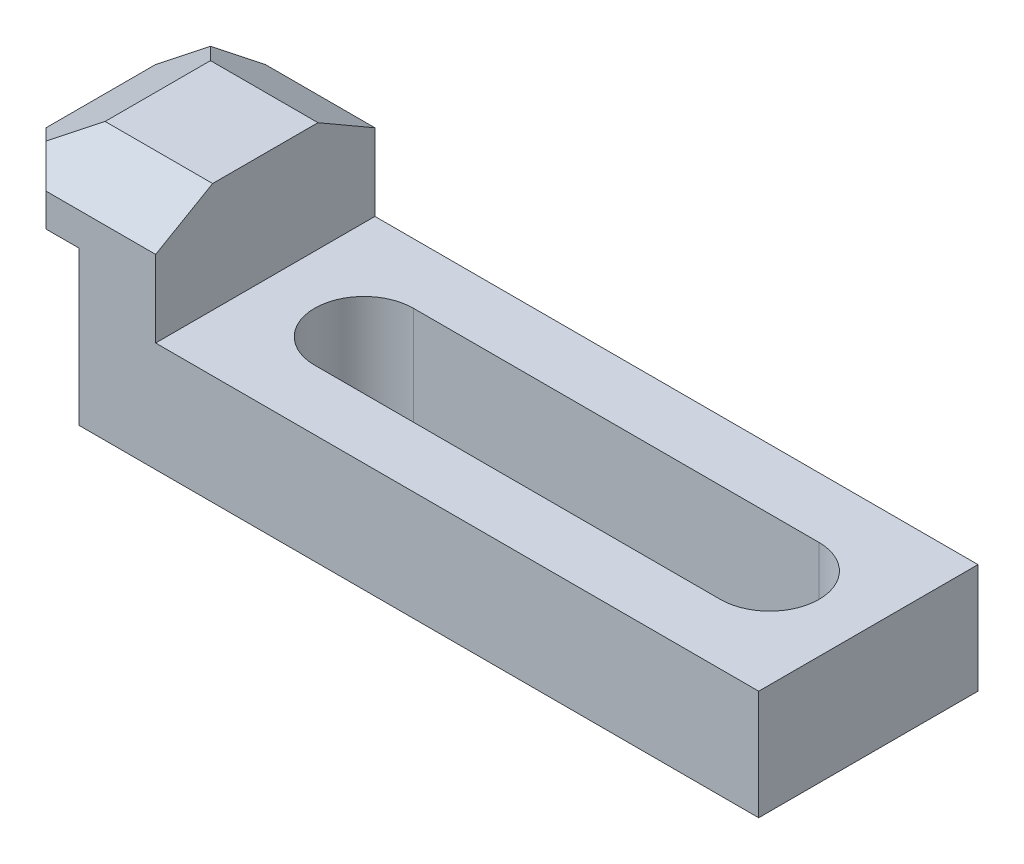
ISO-10303-21;
HEADER;
FILE_DESCRIPTION(('STEP AP214'),'2;1');
FILE_NAME('part.step','',(''),(''),'','','');
FILE_SCHEMA(('AUTOMOTIVE_DESIGN { 1 0 10303 214 1 1 1 1 }'));
ENDSEC;
DATA;
#1=APPLICATION_CONTEXT('core data for automotive mechanical design processes');
#2=APPLICATION_PROTOCOL_DEFINITION('international standard','automotive_design',2000,#1);
#3=PRODUCT_CONTEXT('',#1,'mechanical');
#4=PRODUCT('Part','Part','',(#3));
#5=PRODUCT_RELATED_PRODUCT_CATEGORY('part','',(#4));
#6=PRODUCT_DEFINITION_FORMATION('','',#4);
#7=PRODUCT_DEFINITION_CONTEXT('part definition',#1,'design');
#8=PRODUCT_DEFINITION('design','',#6,#7);
#9=PRODUCT_DEFINITION_SHAPE('','',#8);
#10=(LENGTH_UNIT() NAMED_UNIT(*) SI_UNIT(.MILLI.,.METRE.));
#11=(NAMED_UNIT(*) PLANE_ANGLE_UNIT() SI_UNIT($,.RADIAN.));
#12=(NAMED_UNIT(*) SI_UNIT($,.STERADIAN.) SOLID_ANGLE_UNIT());
#13=UNCERTAINTY_MEASURE_WITH_UNIT(LENGTH_MEASURE(1.E-05),#10,'distance_accuracy_value','');
#14=(GEOMETRIC_REPRESENTATION_CONTEXT(3) GLOBAL_UNCERTAINTY_ASSIGNED_CONTEXT((#13)) GLOBAL_UNIT_ASSIGNED_CONTEXT((#10,
#11,#12)) REPRESENTATION_CONTEXT('',''));
#15=CARTESIAN_POINT('',(0.,0.,0.));
#16=DIRECTION('',(0.,0.,1.));
#17=DIRECTION('',(1.,0.,0.));
#18=AXIS2_PLACEMENT_3D('',#15,#16,#17);
#19=CARTESIAN_POINT('',(0.,6.,10.));
#20=DIRECTION('',(1.,0.,0.));
#21=DIRECTION('',(0.,1.,0.));
#22=AXIS2_PLACEMENT_3D('',#19,#20,#21);
#23=PLANE('',#22);
#24=DIRECTION('',(0.,0.,-1.));
#25=VECTOR('',#24,1.);
#26=CARTESIAN_POINT('',(0.,2.99999999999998,10.));
#27=LINE('',#26,#25);
#28=CARTESIAN_POINT('',(0.,2.99999999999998,5.));
#29=VERTEX_POINT('',#28);
#30=CARTESIAN_POINT('',(0.,2.99999999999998,-5.));
#31=VERTEX_POINT('',#30);
#32=EDGE_CURVE('E171',#29,#31,#27,.T.);
#33=ORIENTED_EDGE('',*,*,#32,.T.);
#34=DIRECTION('',(0.,-1.,0.));
#35=VECTOR('',#34,1.);
#36=CARTESIAN_POINT('',(0.,6.,-5.));
#37=LINE('',#36,#35);
#38=CARTESIAN_POINT('',(0.,0.,-5.));
#39=VERTEX_POINT('',#38);
#40=EDGE_CURVE('E156',#31,#39,#37,.T.);
#41=ORIENTED_EDGE('',*,*,#40,.T.);
#42=DIRECTION('',(0.,0.,-1.));
#43=VECTOR('',#42,1.);
#44=CARTESIAN_POINT('',(0.,0.,10.));
#45=LINE('',#44,#43);
#46=CARTESIAN_POINT('',(0.,0.,5.));
#47=VERTEX_POINT('',#46);
#48=EDGE_CURVE('E237',#47,#39,#45,.T.);
#49=ORIENTED_EDGE('',*,*,#48,.F.);
#50=DIRECTION('',(0.,-1.,0.));
#51=VECTOR('',#50,1.);
#52=CARTESIAN_POINT('',(0.,6.,5.));
#53=LINE('',#52,#51);
#54=EDGE_CURVE('E177',#29,#47,#53,.T.);
#55=ORIENTED_EDGE('',*,*,#54,.F.);
#56=EDGE_LOOP('',(#33,#41,#49,#55));
#57=FACE_BOUND('',#56,.T.);
#58=ADVANCED_FACE('F39',(#57),#23,.F.);
#59=CARTESIAN_POINT('',(0.,0.,10.));
#60=DIRECTION('',(0.,1.,0.));
#61=DIRECTION('',(0.,0.,1.));
#62=AXIS2_PLACEMENT_3D('',#59,#60,#61);
#63=PLANE('',#62);
#64=ORIENTED_EDGE('',*,*,#48,.T.);
#65=DIRECTION('',(0.707106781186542,0.,-0.707106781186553));
#66=VECTOR('',#65,1.);
#67=CARTESIAN_POINT('',(-7.5,0.,2.50000000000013));
#68=LINE('',#67,#66);
#69=CARTESIAN_POINT('',(4.99999999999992,0.,-10.));
#70=VERTEX_POINT('',#69);
#71=EDGE_CURVE('E159',#39,#70,#68,.T.);
#72=ORIENTED_EDGE('',*,*,#71,.T.);
#73=DIRECTION('',(1.,0.,0.));
#74=VECTOR('',#73,1.);
#75=CARTESIAN_POINT('',(0.,0.,-10.));
#76=LINE('',#75,#74);
#77=CARTESIAN_POINT('',(8.,0.,-10.));
#78=VERTEX_POINT('',#77);
#79=EDGE_CURVE('E198',#70,#78,#76,.T.);
#80=ORIENTED_EDGE('',*,*,#79,.T.);
#81=DIRECTION('',(0.,0.,-1.));
#82=VECTOR('',#81,1.);
#83=CARTESIAN_POINT('',(8.,0.,10.));
#84=LINE('',#83,#82);
#85=CARTESIAN_POINT('',(8.,0.,10.));
#86=VERTEX_POINT('',#85);
#87=EDGE_CURVE('E353',#86,#78,#84,.T.);
#88=ORIENTED_EDGE('',*,*,#87,.F.);
#89=DIRECTION('',(1.,0.,0.));
#90=VECTOR('',#89,1.);
#91=CARTESIAN_POINT('',(0.,0.,10.));
#92=LINE('',#91,#90);
#93=CARTESIAN_POINT('',(4.99999999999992,0.,10.));
#94=VERTEX_POINT('',#93);
#95=EDGE_CURVE('E306',#94,#86,#92,.T.);
#96=ORIENTED_EDGE('',*,*,#95,.F.);
#97=DIRECTION('',(-0.707106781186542,0.,-0.707106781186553));
#98=VECTOR('',#97,1.);
#99=CARTESIAN_POINT('',(2.5,0.,7.50000000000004));
#100=LINE('',#99,#98);
#101=EDGE_CURVE('E278',#94,#47,#100,.T.);
#102=ORIENTED_EDGE('',*,*,#101,.T.);
#103=EDGE_LOOP('',(#64,#72,#80,#88,#96,#102));
#104=FACE_BOUND('',#103,.T.);
#105=ADVANCED_FACE('F358',(#104),#63,.F.);
#106=CARTESIAN_POINT('',(8.,0.,10.));
#107=DIRECTION('',(1.,0.,0.));
#108=DIRECTION('',(0.,1.,0.));
#109=AXIS2_PLACEMENT_3D('',#106,#107,#108);
#110=PLANE('',#109);
#111=DIRECTION('',(0.,-1.,0.));
#112=VECTOR('',#111,1.);
#113=CARTESIAN_POINT('',(8.,0.,-10.));
#114=LINE('',#113,#112);
#115=CARTESIAN_POINT('',(8.,-14.,-10.));
#116=VERTEX_POINT('',#115);
#117=EDGE_CURVE('E325',#78,#116,#114,.T.);
#118=ORIENTED_EDGE('',*,*,#117,.T.);
#119=DIRECTION('',(0.,0.,-1.));
#120=VECTOR('',#119,1.);
#121=CARTESIAN_POINT('',(8.,-14.,10.));
#122=LINE('',#121,#120);
#123=CARTESIAN_POINT('',(8.,-14.,10.));
#124=VERTEX_POINT('',#123);
#125=EDGE_CURVE('E349',#124,#116,#122,.T.);
#126=ORIENTED_EDGE('',*,*,#125,.F.);
#127=DIRECTION('',(0.,-1.,0.));
#128=VECTOR('',#127,1.);
#129=CARTESIAN_POINT('',(8.,0.,10.));
#130=LINE('',#129,#128);
#131=EDGE_CURVE('E309',#86,#124,#130,.T.);
#132=ORIENTED_EDGE('',*,*,#131,.F.);
#133=ORIENTED_EDGE('',*,*,#87,.T.);
#134=EDGE_LOOP('',(#118,#126,#132,#133));
#135=FACE_BOUND('',#134,.T.);
#136=ADVANCED_FACE('F381',(#135),#110,.F.);
#137=CARTESIAN_POINT('',(8.,-14.,10.));
#138=DIRECTION('',(0.,1.,0.));
#139=DIRECTION('',(0.,0.,1.));
#140=AXIS2_PLACEMENT_3D('',#137,#138,#139);
#141=PLANE('',#140);
#142=DIRECTION('',(1.,0.,0.));
#143=VECTOR('',#142,1.);
#144=CARTESIAN_POINT('',(24.,-14.,-4.5));
#145=LINE('',#144,#143);
#146=CARTESIAN_POINT('',(24.,-14.,-4.5));
#147=VERTEX_POINT('',#146);
#148=CARTESIAN_POINT('',(61.,-14.,-4.5));
#149=VERTEX_POINT('',#148);
#150=EDGE_CURVE('E284',#147,#149,#145,.T.);
#151=ORIENTED_EDGE('',*,*,#150,.F.);
#152=CARTESIAN_POINT('',(24.,-14.,0.));
#153=DIRECTION('',(0.,-1.,0.));
#154=DIRECTION('',(0.,0.,-1.));
#155=AXIS2_PLACEMENT_3D('',#152,#153,#154);
#156=CIRCLE('',#155,4.5);
#157=CARTESIAN_POINT('',(24.,-14.,4.5));
#158=VERTEX_POINT('',#157);
#159=EDGE_CURVE('E281',#158,#147,#156,.T.);
#160=ORIENTED_EDGE('',*,*,#159,.F.);
#161=DIRECTION('',(-1.,0.,0.));
#162=VECTOR('',#161,1.);
#163=CARTESIAN_POINT('',(24.,-14.,4.5));
#164=LINE('',#163,#162);
#165=CARTESIAN_POINT('',(61.,-14.,4.5));
#166=VERTEX_POINT('',#165);
#167=EDGE_CURVE('E291',#166,#158,#164,.T.);
#168=ORIENTED_EDGE('',*,*,#167,.F.);
#169=CARTESIAN_POINT('',(61.,-14.,0.));
#170=DIRECTION('',(0.,-1.,0.));
#171=DIRECTION('',(0.,0.,-1.));
#172=AXIS2_PLACEMENT_3D('',#169,#170,#171);
#173=CIRCLE('',#172,4.5);
#174=EDGE_CURVE('E287',#149,#166,#173,.T.);
#175=ORIENTED_EDGE('',*,*,#174,.F.);
#176=EDGE_LOOP('',(#151,#160,#168,#175));
#177=FACE_BOUND('',#176,.T.);
#178=DIRECTION('',(1.,0.,0.));
#179=VECTOR('',#178,1.);
#180=CARTESIAN_POINT('',(8.,-14.,-10.));
#181=LINE('',#180,#179);
#182=CARTESIAN_POINT('',(70.,-14.,-10.));
#183=VERTEX_POINT('',#182);
#184=EDGE_CURVE('E328',#116,#183,#181,.T.);
#185=ORIENTED_EDGE('',*,*,#184,.T.);
#186=DIRECTION('',(0.,0.,-1.));
#187=VECTOR('',#186,1.);
#188=CARTESIAN_POINT('',(70.,-14.,10.));
#189=LINE('',#188,#187);
#190=CARTESIAN_POINT('',(70.,-14.,10.));
#191=VERTEX_POINT('',#190);
#192=EDGE_CURVE('E345',#191,#183,#189,.T.);
#193=ORIENTED_EDGE('',*,*,#192,.F.);
#194=DIRECTION('',(1.,0.,0.));
#195=VECTOR('',#194,1.);
#196=CARTESIAN_POINT('',(8.,-14.,10.));
#197=LINE('',#196,#195);
#198=EDGE_CURVE('E312',#124,#191,#197,.T.);
#199=ORIENTED_EDGE('',*,*,#198,.F.);
#200=ORIENTED_EDGE('',*,*,#125,.T.);
#201=EDGE_LOOP('',(#185,#193,#199,#200));
#202=FACE_BOUND('',#201,.T.);
#203=ADVANCED_FACE('F378',(#177,#202),#141,.F.);
#204=CARTESIAN_POINT('',(70.,-14.,10.));
#205=DIRECTION('',(-1.,0.,0.));
#206=DIRECTION('',(0.,0.,1.));
#207=AXIS2_PLACEMENT_3D('',#204,#205,#206);
#208=PLANE('',#207);
#209=DIRECTION('',(0.,1.,0.));
#210=VECTOR('',#209,1.);
#211=CARTESIAN_POINT('',(70.,-14.,-10.));
#212=LINE('',#211,#210);
#213=CARTESIAN_POINT('',(70.,-4.,-10.));
#214=VERTEX_POINT('',#213);
#215=EDGE_CURVE('E331',#183,#214,#212,.T.);
#216=ORIENTED_EDGE('',*,*,#215,.T.);
#217=DIRECTION('',(0.,0.,-1.));
#218=VECTOR('',#217,1.);
#219=CARTESIAN_POINT('',(70.,-4.,10.));
#220=LINE('',#219,#218);
#221=CARTESIAN_POINT('',(70.,-4.,10.));
#222=VERTEX_POINT('',#221);
#223=EDGE_CURVE('E341',#222,#214,#220,.T.);
#224=ORIENTED_EDGE('',*,*,#223,.F.);
#225=DIRECTION('',(0.,1.,0.));
#226=VECTOR('',#225,1.);
#227=CARTESIAN_POINT('',(70.,-14.,10.));
#228=LINE('',#227,#226);
#229=EDGE_CURVE('E315',#191,#222,#228,.T.);
#230=ORIENTED_EDGE('',*,*,#229,.F.);
#231=ORIENTED_EDGE('',*,*,#192,.T.);
#232=EDGE_LOOP('',(#216,#224,#230,#231));
#233=FACE_BOUND('',#232,.T.);
#234=ADVANCED_FACE('F374',(#233),#208,.F.);
#235=CARTESIAN_POINT('',(70.,-4.,10.));
#236=DIRECTION('',(0.,-1.,0.));
#237=DIRECTION('',(1.,0.,0.));
#238=AXIS2_PLACEMENT_3D('',#235,#236,#237);
#239=PLANE('',#238);
#240=DIRECTION('',(-1.,0.,0.));
#241=VECTOR('',#240,1.);
#242=CARTESIAN_POINT('',(70.,-4.,4.5));
#243=LINE('',#242,#241);
#244=CARTESIAN_POINT('',(61.,-4.,4.5));
#245=VERTEX_POINT('',#244);
#246=CARTESIAN_POINT('',(24.,-4.,4.5));
#247=VERTEX_POINT('',#246);
#248=EDGE_CURVE('E203',#245,#247,#243,.T.);
#249=ORIENTED_EDGE('',*,*,#248,.T.);
#250=CARTESIAN_POINT('',(24.,-4.,0.));
#251=DIRECTION('',(0.,-1.,0.));
#252=DIRECTION('',(1.,0.,0.));
#253=AXIS2_PLACEMENT_3D('',#250,#251,#252);
#254=CIRCLE('',#253,4.5);
#255=CARTESIAN_POINT('',(24.,-4.,-4.5));
#256=VERTEX_POINT('',#255);
#257=EDGE_CURVE('E207',#247,#256,#254,.T.);
#258=ORIENTED_EDGE('',*,*,#257,.T.);
#259=DIRECTION('',(1.,0.,0.));
#260=VECTOR('',#259,1.);
#261=CARTESIAN_POINT('',(70.,-4.,-4.5));
#262=LINE('',#261,#260);
#263=CARTESIAN_POINT('',(61.,-4.,-4.5));
#264=VERTEX_POINT('',#263);
#265=EDGE_CURVE('E179',#256,#264,#262,.T.);
#266=ORIENTED_EDGE('',*,*,#265,.T.);
#267=CARTESIAN_POINT('',(61.,-4.,0.));
#268=DIRECTION('',(0.,-1.,0.));
#269=DIRECTION('',(1.,0.,0.));
#270=AXIS2_PLACEMENT_3D('',#267,#268,#269);
#271=CIRCLE('',#270,4.5);
#272=EDGE_CURVE('E185',#264,#245,#271,.T.);
#273=ORIENTED_EDGE('',*,*,#272,.T.);
#274=EDGE_LOOP('',(#249,#258,#266,#273));
#275=FACE_BOUND('',#274,.T.);
#276=DIRECTION('',(-1.,0.,0.));
#277=VECTOR('',#276,1.);
#278=CARTESIAN_POINT('',(70.,-4.,-10.));
#279=LINE('',#278,#277);
#280=CARTESIAN_POINT('',(15.,-4.00000000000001,-10.));
#281=VERTEX_POINT('',#280);
#282=EDGE_CURVE('E334',#214,#281,#279,.T.);
#283=ORIENTED_EDGE('',*,*,#282,.T.);
#284=DIRECTION('',(0.,0.,-1.));
#285=VECTOR('',#284,1.);
#286=CARTESIAN_POINT('',(15.,-4.00000000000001,10.));
#287=LINE('',#286,#285);
#288=CARTESIAN_POINT('',(15.,-4.00000000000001,10.));
#289=VERTEX_POINT('',#288);
#290=EDGE_CURVE('E257',#289,#281,#287,.T.);
#291=ORIENTED_EDGE('',*,*,#290,.F.);
#292=DIRECTION('',(-1.,0.,0.));
#293=VECTOR('',#292,1.);
#294=CARTESIAN_POINT('',(70.,-4.,10.));
#295=LINE('',#294,#293);
#296=EDGE_CURVE('E318',#222,#289,#295,.T.);
#297=ORIENTED_EDGE('',*,*,#296,.F.);
#298=ORIENTED_EDGE('',*,*,#223,.T.);
#299=EDGE_LOOP('',(#283,#291,#297,#298));
#300=FACE_BOUND('',#299,.T.);
#301=ADVANCED_FACE('F370',(#275,#300),#239,.F.);
#302=CARTESIAN_POINT('',(15.,-4.00000000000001,10.));
#303=DIRECTION('',(-1.,0.,0.));
#304=DIRECTION('',(0.,0.,1.));
#305=AXIS2_PLACEMENT_3D('',#302,#303,#304);
#306=PLANE('',#305);
#307=DIRECTION('',(0.,1.,0.));
#308=VECTOR('',#307,1.);
#309=CARTESIAN_POINT('',(15.,-4.00000000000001,-10.));
#310=LINE('',#309,#308);
#311=CARTESIAN_POINT('',(15.,2.99999999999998,-10.));
#312=VERTEX_POINT('',#311);
#313=EDGE_CURVE('E251',#281,#312,#310,.T.);
#314=ORIENTED_EDGE('',*,*,#313,.T.);
#315=DIRECTION('',(0.,-0.500000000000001,-0.866025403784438));
#316=VECTOR('',#315,1.);
#317=CARTESIAN_POINT('',(15.,6.,-4.80384757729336));
#318=LINE('',#317,#316);
#319=CARTESIAN_POINT('',(15.,6.,-4.80384757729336));
#320=VERTEX_POINT('',#319);
#321=EDGE_CURVE('E189',#312,#320,#318,.F.);
#322=ORIENTED_EDGE('',*,*,#321,.T.);
#323=DIRECTION('',(0.,0.,-1.));
#324=VECTOR('',#323,1.);
#325=CARTESIAN_POINT('',(15.,6.,10.));
#326=LINE('',#325,#324);
#327=CARTESIAN_POINT('',(15.,6.,4.80384757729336));
#328=VERTEX_POINT('',#327);
#329=EDGE_CURVE('E248',#328,#320,#326,.T.);
#330=ORIENTED_EDGE('',*,*,#329,.F.);
#331=DIRECTION('',(0.,-0.500000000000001,0.866025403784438));
#332=VECTOR('',#331,1.);
#333=CARTESIAN_POINT('',(15.,2.99999999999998,10.));
#334=LINE('',#333,#332);
#335=CARTESIAN_POINT('',(15.,2.99999999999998,10.));
#336=VERTEX_POINT('',#335);
#337=EDGE_CURVE('E222',#328,#336,#334,.T.);
#338=ORIENTED_EDGE('',*,*,#337,.T.);
#339=DIRECTION('',(0.,1.,0.));
#340=VECTOR('',#339,1.);
#341=CARTESIAN_POINT('',(15.,-4.00000000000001,10.));
#342=LINE('',#341,#340);
#343=EDGE_CURVE('E258',#289,#336,#342,.T.);
#344=ORIENTED_EDGE('',*,*,#343,.F.);
#345=ORIENTED_EDGE('',*,*,#290,.T.);
#346=EDGE_LOOP('',(#314,#322,#330,#338,#344,#345));
#347=FACE_BOUND('',#346,.T.);
#348=ADVANCED_FACE('F247',(#347),#306,.F.);
#349=CARTESIAN_POINT('',(15.,6.,10.));
#350=DIRECTION('',(0.,-1.,0.));
#351=DIRECTION('',(1.,0.,0.));
#352=AXIS2_PLACEMENT_3D('',#349,#350,#351);
#353=PLANE('',#352);
#354=ORIENTED_EDGE('',*,*,#329,.T.);
#355=DIRECTION('',(-1.,0.,0.));
#356=VECTOR('',#355,1.);
#357=CARTESIAN_POINT('',(15.,6.,-4.80384757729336));
#358=LINE('',#357,#356);
#359=CARTESIAN_POINT('',(5.19615242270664,6.,-4.80384757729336));
#360=VERTEX_POINT('',#359);
#361=EDGE_CURVE('E227',#320,#360,#358,.T.);
#362=ORIENTED_EDGE('',*,*,#361,.T.);
#363=DIRECTION('',(0.,0.,1.));
#364=VECTOR('',#363,1.);
#365=CARTESIAN_POINT('',(5.19615242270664,6.,10.));
#366=LINE('',#365,#364);
#367=CARTESIAN_POINT('',(5.19615242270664,6.,4.80384757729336));
#368=VERTEX_POINT('',#367);
#369=EDGE_CURVE('E228',#360,#368,#366,.T.);
#370=ORIENTED_EDGE('',*,*,#369,.T.);
#371=DIRECTION('',(1.,0.,0.));
#372=VECTOR('',#371,1.);
#373=CARTESIAN_POINT('',(15.,6.,4.80384757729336));
#374=LINE('',#373,#372);
#375=EDGE_CURVE('E221',#368,#328,#374,.T.);
#376=ORIENTED_EDGE('',*,*,#375,.T.);
#377=EDGE_LOOP('',(#354,#362,#370,#376));
#378=FACE_BOUND('',#377,.T.);
#379=ADVANCED_FACE('F255',(#378),#353,.F.);
#380=CARTESIAN_POINT('',(0.,0.,10.));
#381=DIRECTION('',(0.,0.,1.));
#382=DIRECTION('',(1.,0.,0.));
#383=AXIS2_PLACEMENT_3D('',#380,#381,#382);
#384=PLANE('',#383);
#385=DIRECTION('',(0.,-1.,0.));
#386=VECTOR('',#385,1.);
#387=CARTESIAN_POINT('',(4.99999999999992,6.,10.));
#388=LINE('',#387,#386);
#389=CARTESIAN_POINT('',(4.99999999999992,2.99999999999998,10.));
#390=VERTEX_POINT('',#389);
#391=EDGE_CURVE('E270',#390,#94,#388,.T.);
#392=ORIENTED_EDGE('',*,*,#391,.T.);
#393=ORIENTED_EDGE('',*,*,#95,.T.);
#394=ORIENTED_EDGE('',*,*,#131,.T.);
#395=ORIENTED_EDGE('',*,*,#198,.T.);
#396=ORIENTED_EDGE('',*,*,#229,.T.);
#397=ORIENTED_EDGE('',*,*,#296,.T.);
#398=ORIENTED_EDGE('',*,*,#343,.T.);
#399=DIRECTION('',(-1.,0.,0.));
#400=VECTOR('',#399,1.);
#401=CARTESIAN_POINT('',(0.,2.99999999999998,10.));
#402=LINE('',#401,#400);
#403=EDGE_CURVE('E180',#336,#390,#402,.T.);
#404=ORIENTED_EDGE('',*,*,#403,.T.);
#405=EDGE_LOOP('',(#392,#393,#394,#395,#396,#397,#398,#404));
#406=FACE_BOUND('',#405,.T.);
#407=ADVANCED_FACE('F362',(#406),#384,.T.);
#408=CARTESIAN_POINT('',(0.,0.,-10.));
#409=DIRECTION('',(0.,0.,1.));
#410=DIRECTION('',(1.,0.,0.));
#411=AXIS2_PLACEMENT_3D('',#408,#409,#410);
#412=PLANE('',#411);
#413=ORIENTED_EDGE('',*,*,#79,.F.);
#414=DIRECTION('',(0.,-1.,0.));
#415=VECTOR('',#414,1.);
#416=CARTESIAN_POINT('',(4.99999999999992,6.,-10.));
#417=LINE('',#416,#415);
#418=CARTESIAN_POINT('',(4.99999999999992,2.99999999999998,-10.));
#419=VERTEX_POINT('',#418);
#420=EDGE_CURVE('E165',#419,#70,#417,.T.);
#421=ORIENTED_EDGE('',*,*,#420,.F.);
#422=DIRECTION('',(1.,0.,0.));
#423=VECTOR('',#422,1.);
#424=CARTESIAN_POINT('',(0.,2.99999999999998,-10.));
#425=LINE('',#424,#423);
#426=EDGE_CURVE('E234',#419,#312,#425,.T.);
#427=ORIENTED_EDGE('',*,*,#426,.T.);
#428=ORIENTED_EDGE('',*,*,#313,.F.);
#429=ORIENTED_EDGE('',*,*,#282,.F.);
#430=ORIENTED_EDGE('',*,*,#215,.F.);
#431=ORIENTED_EDGE('',*,*,#184,.F.);
#432=ORIENTED_EDGE('',*,*,#117,.F.);
#433=EDGE_LOOP('',(#413,#421,#427,#428,#429,#430,#431,#432));
#434=FACE_BOUND('',#433,.T.);
#435=ADVANCED_FACE('F264',(#434),#412,.F.);
#436=CARTESIAN_POINT('',(0.,2.99999999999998,10.));
#437=DIRECTION('',(0.,0.866025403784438,0.500000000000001));
#438=DIRECTION('',(0.,-0.500000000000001,0.866025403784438));
#439=AXIS2_PLACEMENT_3D('',#436,#437,#438);
#440=PLANE('',#439);
#441=DIRECTION('',(-0.654653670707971,0.377964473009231,-0.654653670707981));
#442=VECTOR('',#441,1.);
#443=CARTESIAN_POINT('',(2.85714285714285,4.23717914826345,7.8571428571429));
#444=LINE('',#443,#442);
#445=CARTESIAN_POINT('',(2.49999999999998,4.44337567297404,7.50000000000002));
#446=VERTEX_POINT('',#445);
#447=EDGE_CURVE('E62',#390,#446,#444,.T.);
#448=ORIENTED_EDGE('',*,*,#447,.F.);
#449=ORIENTED_EDGE('',*,*,#403,.F.);
#450=ORIENTED_EDGE('',*,*,#337,.F.);
#451=ORIENTED_EDGE('',*,*,#375,.F.);
#452=DIRECTION('',(-0.654653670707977,-0.377964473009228,0.654653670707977));
#453=VECTOR('',#452,1.);
#454=CARTESIAN_POINT('',(0.,2.99999999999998,10.));
#455=LINE('',#454,#453);
#456=EDGE_CURVE('E195',#446,#368,#455,.F.);
#457=ORIENTED_EDGE('',*,*,#456,.F.);
#458=EDGE_LOOP('',(#448,#449,#450,#451,#457));
#459=FACE_BOUND('',#458,.T.);
#460=ADVANCED_FACE('F41',(#459),#440,.T.);
#461=CARTESIAN_POINT('',(0.,2.99999999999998,10.));
#462=DIRECTION('',(0.500000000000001,-0.866025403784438,0.));
#463=DIRECTION('',(0.866025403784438,0.500000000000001,0.));
#464=AXIS2_PLACEMENT_3D('',#461,#462,#463);
#465=PLANE('',#464);
#466=DIRECTION('',(-0.654653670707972,-0.377964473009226,0.654653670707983));
#467=VECTOR('',#466,1.);
#468=CARTESIAN_POINT('',(-6.42857142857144,-0.711537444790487,1.42857142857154));
#469=LINE('',#468,#467);
#470=CARTESIAN_POINT('',(2.49999999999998,4.44337567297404,-7.50000000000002));
#471=VERTEX_POINT('',#470);
#472=EDGE_CURVE('E54',#31,#471,#469,.F.);
#473=ORIENTED_EDGE('',*,*,#472,.F.);
#474=ORIENTED_EDGE('',*,*,#32,.F.);
#475=DIRECTION('',(0.654653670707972,0.377964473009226,0.654653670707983));
#476=VECTOR('',#475,1.);
#477=CARTESIAN_POINT('',(2.14285714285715,4.23717914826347,7.14285714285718));
#478=LINE('',#477,#476);
#479=EDGE_CURVE('E48',#446,#29,#478,.F.);
#480=ORIENTED_EDGE('',*,*,#479,.F.);
#481=ORIENTED_EDGE('',*,*,#456,.T.);
#482=ORIENTED_EDGE('',*,*,#369,.F.);
#483=DIRECTION('',(-0.654653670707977,-0.377964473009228,-0.654653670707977));
#484=VECTOR('',#483,1.);
#485=CARTESIAN_POINT('',(8.57142857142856,7.94871659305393,-1.42857142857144));
#486=LINE('',#485,#484);
#487=EDGE_CURVE('E173',#471,#360,#486,.F.);
#488=ORIENTED_EDGE('',*,*,#487,.F.);
#489=EDGE_LOOP('',(#473,#474,#480,#481,#482,#488));
#490=FACE_BOUND('',#489,.T.);
#491=ADVANCED_FACE('F170',(#490),#465,.F.);
#492=CARTESIAN_POINT('',(15.,6.,-4.80384757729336));
#493=DIRECTION('',(0.,-0.866025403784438,0.500000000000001));
#494=DIRECTION('',(0.,-0.500000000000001,-0.866025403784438));
#495=AXIS2_PLACEMENT_3D('',#492,#493,#494);
#496=PLANE('',#495);
#497=DIRECTION('',(-0.654653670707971,0.377964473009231,0.654653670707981));
#498=VECTOR('',#497,1.);
#499=CARTESIAN_POINT('',(6.31648432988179,2.23992741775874,-11.3164843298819));
#500=LINE('',#499,#498);
#501=EDGE_CURVE('E11',#471,#419,#500,.F.);
#502=ORIENTED_EDGE('',*,*,#501,.F.);
#503=ORIENTED_EDGE('',*,*,#487,.T.);
#504=ORIENTED_EDGE('',*,*,#361,.F.);
#505=ORIENTED_EDGE('',*,*,#321,.F.);
#506=ORIENTED_EDGE('',*,*,#426,.F.);
#507=EDGE_LOOP('',(#502,#503,#504,#505,#506));
#508=FACE_BOUND('',#507,.T.);
#509=ADVANCED_FACE('F260',(#508),#496,.F.);
#510=CARTESIAN_POINT('',(24.,6.,0.));
#511=DIRECTION('',(0.,-1.,0.));
#512=DIRECTION('',(0.,0.,-1.));
#513=AXIS2_PLACEMENT_3D('',#510,#511,#512);
#514=CYLINDRICAL_SURFACE('',#513,4.5);
#515=DIRECTION('',(0.,-1.,0.));
#516=VECTOR('',#515,1.);
#517=CARTESIAN_POINT('',(24.,6.,4.5));
#518=LINE('',#517,#516);
#519=EDGE_CURVE('E196',#247,#158,#518,.T.);
#520=ORIENTED_EDGE('',*,*,#519,.T.);
#521=ORIENTED_EDGE('',*,*,#159,.T.);
#522=DIRECTION('',(0.,-1.,0.));
#523=VECTOR('',#522,1.);
#524=CARTESIAN_POINT('',(24.,6.,-4.5));
#525=LINE('',#524,#523);
#526=EDGE_CURVE('E295',#256,#147,#525,.T.);
#527=ORIENTED_EDGE('',*,*,#526,.F.);
#528=ORIENTED_EDGE('',*,*,#257,.F.);
#529=EDGE_LOOP('',(#520,#521,#527,#528));
#530=FACE_BOUND('',#529,.T.);
#531=ADVANCED_FACE('F398',(#530),#514,.F.);
#532=CARTESIAN_POINT('',(24.,6.,4.5));
#533=DIRECTION('',(0.,0.,1.));
#534=DIRECTION('',(1.,0.,0.));
#535=AXIS2_PLACEMENT_3D('',#532,#533,#534);
#536=PLANE('',#535);
#537=DIRECTION('',(0.,-1.,0.));
#538=VECTOR('',#537,1.);
#539=CARTESIAN_POINT('',(61.,6.,4.5));
#540=LINE('',#539,#538);
#541=EDGE_CURVE('E298',#245,#166,#540,.T.);
#542=ORIENTED_EDGE('',*,*,#541,.T.);
#543=ORIENTED_EDGE('',*,*,#167,.T.);
#544=ORIENTED_EDGE('',*,*,#519,.F.);
#545=ORIENTED_EDGE('',*,*,#248,.F.);
#546=EDGE_LOOP('',(#542,#543,#544,#545));
#547=FACE_BOUND('',#546,.T.);
#548=ADVANCED_FACE('F458',(#547),#536,.F.);
#549=CARTESIAN_POINT('',(61.,6.,0.));
#550=DIRECTION('',(0.,-1.,0.));
#551=DIRECTION('',(0.,0.,-1.));
#552=AXIS2_PLACEMENT_3D('',#549,#550,#551);
#553=CYLINDRICAL_SURFACE('',#552,4.5);
#554=DIRECTION('',(0.,-1.,0.));
#555=VECTOR('',#554,1.);
#556=CARTESIAN_POINT('',(61.,6.,-4.5));
#557=LINE('',#556,#555);
#558=EDGE_CURVE('E300',#264,#149,#557,.T.);
#559=ORIENTED_EDGE('',*,*,#558,.T.);
#560=ORIENTED_EDGE('',*,*,#174,.T.);
#561=ORIENTED_EDGE('',*,*,#541,.F.);
#562=ORIENTED_EDGE('',*,*,#272,.F.);
#563=EDGE_LOOP('',(#559,#560,#561,#562));
#564=FACE_BOUND('',#563,.T.);
#565=ADVANCED_FACE('F466',(#564),#553,.F.);
#566=CARTESIAN_POINT('',(24.,6.,-4.5));
#567=DIRECTION('',(0.,0.,-1.));
#568=DIRECTION('',(-1.,0.,0.));
#569=AXIS2_PLACEMENT_3D('',#566,#567,#568);
#570=PLANE('',#569);
#571=ORIENTED_EDGE('',*,*,#526,.T.);
#572=ORIENTED_EDGE('',*,*,#150,.T.);
#573=ORIENTED_EDGE('',*,*,#558,.F.);
#574=ORIENTED_EDGE('',*,*,#265,.F.);
#575=EDGE_LOOP('',(#571,#572,#573,#574));
#576=FACE_BOUND('',#575,.T.);
#577=ADVANCED_FACE('F475',(#576),#570,.F.);
#578=CARTESIAN_POINT('',(4.99999999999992,6.,10.));
#579=DIRECTION('',(0.707106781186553,0.,-0.707106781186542));
#580=DIRECTION('',(-0.707106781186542,0.,-0.707106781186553));
#581=AXIS2_PLACEMENT_3D('',#578,#579,#580);
#582=PLANE('',#581);
#583=ORIENTED_EDGE('',*,*,#391,.F.);
#584=ORIENTED_EDGE('',*,*,#447,.T.);
#585=ORIENTED_EDGE('',*,*,#479,.T.);
#586=ORIENTED_EDGE('',*,*,#54,.T.);
#587=ORIENTED_EDGE('',*,*,#101,.F.);
#588=EDGE_LOOP('',(#583,#584,#585,#586,#587));
#589=FACE_BOUND('',#588,.T.);
#590=ADVANCED_FACE('F213',(#589),#582,.F.);
#591=CARTESIAN_POINT('',(4.99999999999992,6.,-10.));
#592=DIRECTION('',(0.707106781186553,0.,0.707106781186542));
#593=DIRECTION('',(0.707106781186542,0.,-0.707106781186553));
#594=AXIS2_PLACEMENT_3D('',#591,#592,#593);
#595=PLANE('',#594);
#596=ORIENTED_EDGE('',*,*,#40,.F.);
#597=ORIENTED_EDGE('',*,*,#472,.T.);
#598=ORIENTED_EDGE('',*,*,#501,.T.);
#599=ORIENTED_EDGE('',*,*,#420,.T.);
#600=ORIENTED_EDGE('',*,*,#71,.F.);
#601=EDGE_LOOP('',(#596,#597,#598,#599,#600));
#602=FACE_BOUND('',#601,.T.);
#603=ADVANCED_FACE('F157',(#602),#595,.F.);
#604=CLOSED_SHELL('',(#58,#105,#136,#203,#234,#301,#348,#379,#407,#435,#460,#491,#509,#531,#548,
#565,#577,#590,#603));
#605=MANIFOLD_SOLID_BREP('B2',#604);
#606=ADVANCED_BREP_SHAPE_REPRESENTATION('',(#18,#605),#14);
#607=SHAPE_DEFINITION_REPRESENTATION(#9,#606);
ENDSEC;
END-ISO-10303-21;
